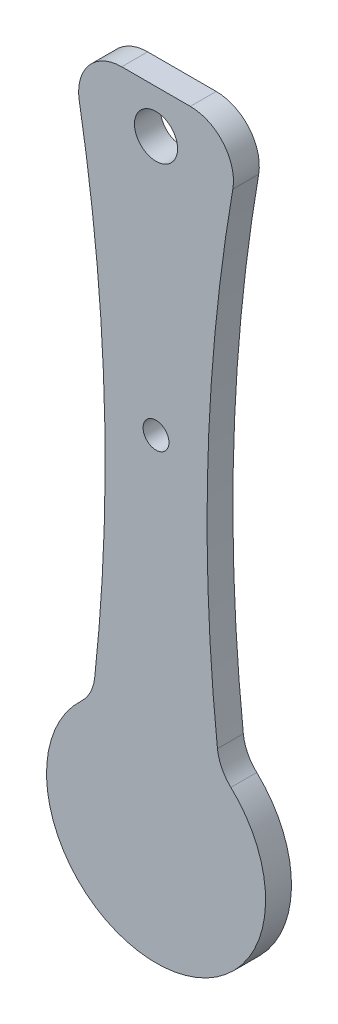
from build123d import *

# Parameters (mm, degrees)
EXTRUSION1_DEPTH        = 3
ESQUISSE2_R             = 1.5
ESQUISSE2_R_2           = 2.5
ENL_V_MAT_EXTRU_1_DEPTH = 3
CONG_1_R                = 5


with BuildPart() as part:
    # Esquisse1 → Extrusion1 (new body)
    with BuildSketch(Plane.XY):
        with BuildLine():
            Line((-13.113644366, 13.077028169), (6.886355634, 13.077028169))
            ThreePointArc((6.886355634, 13.077028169), (2.970775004, -19.28950371), (4.238889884, -51.86734959))
            ThreePointArc((4.238889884, -51.86734959), (-3.109266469, -74.922971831), (-10.457422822, -51.86734959))
            ThreePointArc((-10.457422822, -51.86734959), (-9.185211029, -19.288807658), (-13.113644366, 13.077028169))
        make_face()
    extrude(amount=EXTRUSION1_DEPTH)

    # Esquisse2 → Enl_v. mat.-Extru.1 (cut)
    with BuildSketch(Plane.XY.offset(3)):
        with Locations((-3.113644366, -21.922971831)):
            Circle(ESQUISSE2_R)
        with Locations((-3.113644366, 8.077028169)):
            Circle(ESQUISSE2_R_2)
    extrude(amount=-ENL_V_MAT_EXTRU_1_DEPTH, mode=Mode.SUBTRACT)

    # Cong_1
    cong_1_edges = [part.edges().sort_by_distance(p)[0] for p in [
        (-13.113644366, 13.077028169, 1.5),
        (6.886355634, 13.077028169, 1.5),
        (4.238889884, -51.86734959, 1.5),
        (-10.457422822, -51.86734959, 1.5),
    ]]
    fillet(cong_1_edges, radius=CONG_1_R)


solid = part.part
